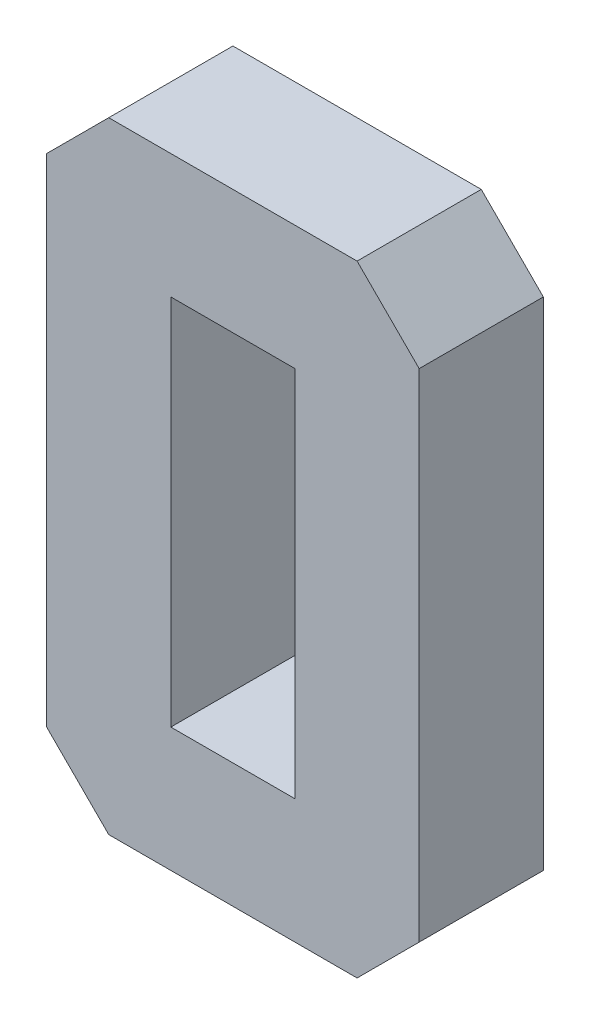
from build123d import *

# Parameters (mm, degrees)
ESQUISSE1_W        = 30
ESQUISSE1_H        = 50
ESQUISSE1_W_2      = 10
ESQUISSE1_H_2      = 30
BOSS_EXTRU_1_DEPTH = 10
CHANFREIN1_SIZE    = 5


with BuildPart() as part:
    # Esquisse1 → Boss.-Extru.1 (new body)
    with BuildSketch(Plane.XY):
        with Locations((15, 25)):
            Rectangle(ESQUISSE1_W, ESQUISSE1_H)
        with Locations((15, 25)):
            Rectangle(ESQUISSE1_W_2, ESQUISSE1_H_2, mode=Mode.SUBTRACT)
    extrude(amount=BOSS_EXTRU_1_DEPTH)

    # Chanfrein1
    chanfrein1_edges = [part.edges().sort_by_distance(p)[0] for p in [
        (0, 50, 5),
        (30, 50, 5),
        (30, 0, 5),
        (0, 0, 5),
    ]]
    chamfer(chanfrein1_edges, length=CHANFREIN1_SIZE)


solid = part.part
